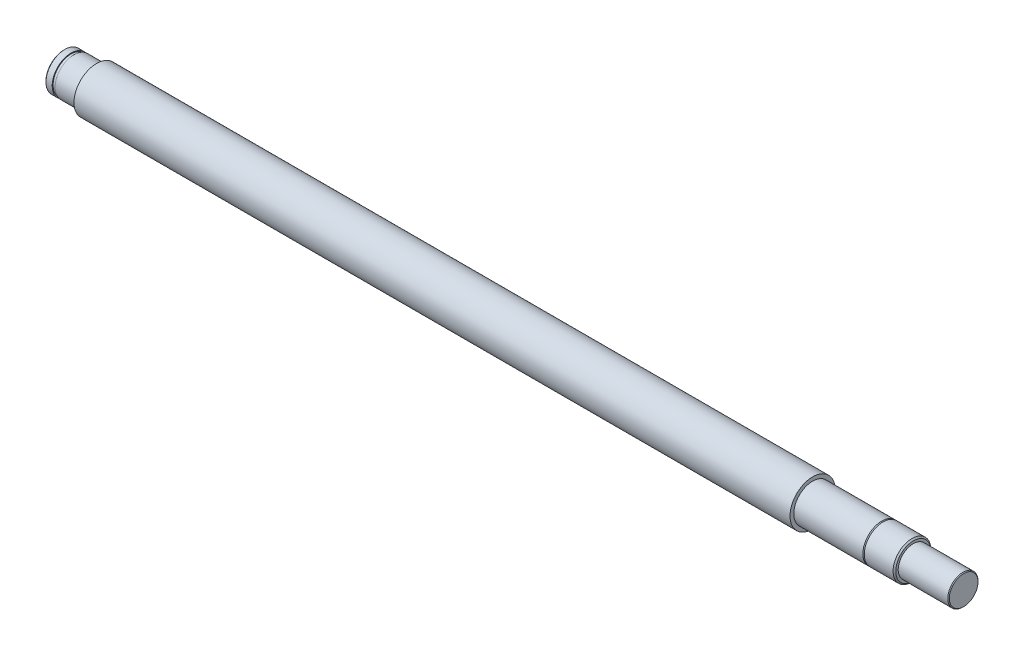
ISO-10303-21;
HEADER;
FILE_DESCRIPTION(('STEP AP214'),'2;1');
FILE_NAME('part.step','',(''),(''),'','','');
FILE_SCHEMA(('AUTOMOTIVE_DESIGN { 1 0 10303 214 1 1 1 1 }'));
ENDSEC;
DATA;
#1=APPLICATION_CONTEXT('core data for automotive mechanical design processes');
#2=APPLICATION_PROTOCOL_DEFINITION('international standard','automotive_design',2000,#1);
#3=PRODUCT_CONTEXT('',#1,'mechanical');
#4=PRODUCT('Part','Part','',(#3));
#5=PRODUCT_RELATED_PRODUCT_CATEGORY('part','',(#4));
#6=PRODUCT_DEFINITION_FORMATION('','',#4);
#7=PRODUCT_DEFINITION_CONTEXT('part definition',#1,'design');
#8=PRODUCT_DEFINITION('design','',#6,#7);
#9=PRODUCT_DEFINITION_SHAPE('','',#8);
#10=(LENGTH_UNIT() NAMED_UNIT(*) SI_UNIT(.MILLI.,.METRE.));
#11=(NAMED_UNIT(*) PLANE_ANGLE_UNIT() SI_UNIT($,.RADIAN.));
#12=(NAMED_UNIT(*) SI_UNIT($,.STERADIAN.) SOLID_ANGLE_UNIT());
#13=UNCERTAINTY_MEASURE_WITH_UNIT(LENGTH_MEASURE(1.E-05),#10,'distance_accuracy_value','');
#14=(GEOMETRIC_REPRESENTATION_CONTEXT(3) GLOBAL_UNCERTAINTY_ASSIGNED_CONTEXT((#13)) GLOBAL_UNIT_ASSIGNED_CONTEXT((#10,
#11,#12)) REPRESENTATION_CONTEXT('',''));
#15=CARTESIAN_POINT('',(0.,0.,0.));
#16=DIRECTION('',(0.,0.,1.));
#17=DIRECTION('',(1.,0.,0.));
#18=AXIS2_PLACEMENT_3D('',#15,#16,#17);
#19=CARTESIAN_POINT('',(-70.1250000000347,0.,0.));
#20=DIRECTION('',(1.,0.,0.));
#21=DIRECTION('',(0.,0.,-1.));
#22=AXIS2_PLACEMENT_3D('',#19,#20,#21);
#23=CONICAL_SURFACE('',#22,7.49999999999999,0.78539816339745);
#24=CARTESIAN_POINT('',(-70.5000000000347,0.,0.));
#25=DIRECTION('',(1.,0.,0.));
#26=DIRECTION('',(0.,0.,-1.));
#27=AXIS2_PLACEMENT_3D('',#24,#25,#26);
#28=CIRCLE('',#27,7.12500000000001);
#29=CARTESIAN_POINT('',(-70.5000000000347,0.,-7.12500000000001));
#30=VERTEX_POINT('',#29);
#31=EDGE_CURVE('E107',#30,#30,#28,.T.);
#32=ORIENTED_EDGE('',*,*,#31,.T.);
#33=EDGE_LOOP('',(#32));
#34=FACE_BOUND('',#33,.T.);
#35=CARTESIAN_POINT('',(-70.1250000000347,0.,0.));
#36=DIRECTION('',(1.,0.,0.));
#37=DIRECTION('',(0.,0.,-1.));
#38=AXIS2_PLACEMENT_3D('',#35,#36,#37);
#39=CIRCLE('',#38,7.49999999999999);
#40=CARTESIAN_POINT('',(-70.1250000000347,0.,-7.5));
#41=VERTEX_POINT('',#40);
#42=EDGE_CURVE('E12',#41,#41,#39,.T.);
#43=ORIENTED_EDGE('',*,*,#42,.F.);
#44=EDGE_LOOP('',(#43));
#45=FACE_BOUND('',#44,.T.);
#46=ADVANCED_FACE('F49',(#34,#45),#23,.T.);
#47=CARTESIAN_POINT('',(-70.5000000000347,0.,0.));
#48=DIRECTION('',(1.,0.,0.));
#49=DIRECTION('',(0.,0.,-1.));
#50=AXIS2_PLACEMENT_3D('',#47,#48,#49);
#51=CYLINDRICAL_SURFACE('',#50,7.49999999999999);
#52=ORIENTED_EDGE('',*,*,#42,.T.);
#53=EDGE_LOOP('',(#52));
#54=FACE_BOUND('',#53,.T.);
#55=CARTESIAN_POINT('',(-67.6500000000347,0.,0.));
#56=DIRECTION('',(1.,0.,0.));
#57=DIRECTION('',(0.,0.,-1.));
#58=AXIS2_PLACEMENT_3D('',#55,#56,#57);
#59=CIRCLE('',#58,7.49999999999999);
#60=CARTESIAN_POINT('',(-67.6500000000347,0.,-7.5));
#61=VERTEX_POINT('',#60);
#62=EDGE_CURVE('E55',#61,#61,#59,.T.);
#63=ORIENTED_EDGE('',*,*,#62,.F.);
#64=EDGE_LOOP('',(#63));
#65=FACE_BOUND('',#64,.T.);
#66=ADVANCED_FACE('F124',(#54,#65),#51,.T.);
#67=CARTESIAN_POINT('',(-67.6500000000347,7.15,0.));
#68=DIRECTION('',(1.,0.,0.));
#69=DIRECTION('',(0.,0.,-1.));
#70=AXIS2_PLACEMENT_3D('',#67,#68,#69);
#71=PLANE('',#70);
#72=ORIENTED_EDGE('',*,*,#62,.T.);
#73=EDGE_LOOP('',(#72));
#74=FACE_BOUND('',#73,.T.);
#75=CARTESIAN_POINT('',(-67.6500000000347,0.,0.));
#76=DIRECTION('',(1.,0.,0.));
#77=DIRECTION('',(0.,0.,-1.));
#78=AXIS2_PLACEMENT_3D('',#75,#76,#77);
#79=CIRCLE('',#78,7.15);
#80=CARTESIAN_POINT('',(-67.6500000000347,0.,-7.15));
#81=VERTEX_POINT('',#80);
#82=EDGE_CURVE('E59',#81,#81,#79,.T.);
#83=ORIENTED_EDGE('',*,*,#82,.F.);
#84=EDGE_LOOP('',(#83));
#85=FACE_BOUND('',#84,.T.);
#86=ADVANCED_FACE('F128',(#74,#85),#71,.T.);
#87=CARTESIAN_POINT('',(-70.5000000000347,0.,0.));
#88=DIRECTION('',(1.,0.,0.));
#89=DIRECTION('',(0.,0.,-1.));
#90=AXIS2_PLACEMENT_3D('',#87,#88,#89);
#91=CYLINDRICAL_SURFACE('',#90,7.15);
#92=ORIENTED_EDGE('',*,*,#82,.T.);
#93=EDGE_LOOP('',(#92));
#94=FACE_BOUND('',#93,.T.);
#95=CARTESIAN_POINT('',(-66.5000000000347,0.,0.));
#96=DIRECTION('',(1.,0.,0.));
#97=DIRECTION('',(0.,0.,-1.));
#98=AXIS2_PLACEMENT_3D('',#95,#96,#97);
#99=CIRCLE('',#98,7.15);
#100=CARTESIAN_POINT('',(-66.5000000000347,0.,-7.15));
#101=VERTEX_POINT('',#100);
#102=EDGE_CURVE('E63',#101,#101,#99,.T.);
#103=ORIENTED_EDGE('',*,*,#102,.F.);
#104=EDGE_LOOP('',(#103));
#105=FACE_BOUND('',#104,.T.);
#106=ADVANCED_FACE('F132',(#94,#105),#91,.T.);
#107=CARTESIAN_POINT('',(-66.5000000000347,7.49999999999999,0.));
#108=DIRECTION('',(-1.,0.,0.));
#109=DIRECTION('',(0.,0.,1.));
#110=AXIS2_PLACEMENT_3D('',#107,#108,#109);
#111=PLANE('',#110);
#112=ORIENTED_EDGE('',*,*,#102,.T.);
#113=EDGE_LOOP('',(#112));
#114=FACE_BOUND('',#113,.T.);
#115=CARTESIAN_POINT('',(-66.5000000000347,0.,0.));
#116=DIRECTION('',(1.,0.,0.));
#117=DIRECTION('',(0.,0.,-1.));
#118=AXIS2_PLACEMENT_3D('',#115,#116,#117);
#119=CIRCLE('',#118,7.49999999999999);
#120=CARTESIAN_POINT('',(-66.5000000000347,0.,-7.5));
#121=VERTEX_POINT('',#120);
#122=EDGE_CURVE('E68',#121,#121,#119,.T.);
#123=ORIENTED_EDGE('',*,*,#122,.F.);
#124=EDGE_LOOP('',(#123));
#125=FACE_BOUND('',#124,.T.);
#126=ADVANCED_FACE('F138',(#114,#125),#111,.T.);
#127=CARTESIAN_POINT('',(-70.5000000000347,0.,0.));
#128=DIRECTION('',(1.,0.,0.));
#129=DIRECTION('',(0.,0.,-1.));
#130=AXIS2_PLACEMENT_3D('',#127,#128,#129);
#131=CYLINDRICAL_SURFACE('',#130,7.49999999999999);
#132=ORIENTED_EDGE('',*,*,#122,.T.);
#133=EDGE_LOOP('',(#132));
#134=FACE_BOUND('',#133,.T.);
#135=CARTESIAN_POINT('',(-57.5000000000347,0.,0.));
#136=DIRECTION('',(1.,0.,0.));
#137=DIRECTION('',(0.,0.,-1.));
#138=AXIS2_PLACEMENT_3D('',#135,#136,#137);
#139=CIRCLE('',#138,7.49999999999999);
#140=CARTESIAN_POINT('',(-57.5000000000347,0.,-7.5));
#141=VERTEX_POINT('',#140);
#142=EDGE_CURVE('E71',#141,#141,#139,.T.);
#143=ORIENTED_EDGE('',*,*,#142,.F.);
#144=EDGE_LOOP('',(#143));
#145=FACE_BOUND('',#144,.T.);
#146=ADVANCED_FACE('F142',(#134,#145),#131,.T.);
#147=CARTESIAN_POINT('',(-57.5000000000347,8.99999999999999,0.));
#148=DIRECTION('',(-1.,0.,0.));
#149=DIRECTION('',(0.,0.,1.));
#150=AXIS2_PLACEMENT_3D('',#147,#148,#149);
#151=PLANE('',#150);
#152=ORIENTED_EDGE('',*,*,#142,.T.);
#153=EDGE_LOOP('',(#152));
#154=FACE_BOUND('',#153,.T.);
#155=CARTESIAN_POINT('',(-57.5000000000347,0.,0.));
#156=DIRECTION('',(1.,0.,0.));
#157=DIRECTION('',(0.,0.,-1.));
#158=AXIS2_PLACEMENT_3D('',#155,#156,#157);
#159=CIRCLE('',#158,8.99999999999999);
#160=CARTESIAN_POINT('',(-57.5000000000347,0.,-9.));
#161=VERTEX_POINT('',#160);
#162=EDGE_CURVE('E74',#161,#161,#159,.T.);
#163=ORIENTED_EDGE('',*,*,#162,.F.);
#164=EDGE_LOOP('',(#163));
#165=FACE_BOUND('',#164,.T.);
#166=ADVANCED_FACE('F146',(#154,#165),#151,.T.);
#167=CARTESIAN_POINT('',(-70.5000000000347,0.,0.));
#168=DIRECTION('',(1.,0.,0.));
#169=DIRECTION('',(0.,0.,-1.));
#170=AXIS2_PLACEMENT_3D('',#167,#168,#169);
#171=CYLINDRICAL_SURFACE('',#170,9.00000000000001);
#172=ORIENTED_EDGE('',*,*,#162,.T.);
#173=EDGE_LOOP('',(#172));
#174=FACE_BOUND('',#173,.T.);
#175=CARTESIAN_POINT('',(227.,0.,0.));
#176=DIRECTION('',(1.,0.,0.));
#177=DIRECTION('',(0.,0.,-1.));
#178=AXIS2_PLACEMENT_3D('',#175,#176,#177);
#179=CIRCLE('',#178,9.00000000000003);
#180=CARTESIAN_POINT('',(227.,0.,-9.00000000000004));
#181=VERTEX_POINT('',#180);
#182=EDGE_CURVE('E77',#181,#181,#179,.T.);
#183=ORIENTED_EDGE('',*,*,#182,.F.);
#184=EDGE_LOOP('',(#183));
#185=FACE_BOUND('',#184,.T.);
#186=ADVANCED_FACE('F150',(#174,#185),#171,.T.);
#187=CARTESIAN_POINT('',(227.,7.50000000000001,0.));
#188=DIRECTION('',(1.,0.,0.));
#189=DIRECTION('',(0.,0.,-1.));
#190=AXIS2_PLACEMENT_3D('',#187,#188,#189);
#191=PLANE('',#190);
#192=ORIENTED_EDGE('',*,*,#182,.T.);
#193=EDGE_LOOP('',(#192));
#194=FACE_BOUND('',#193,.T.);
#195=CARTESIAN_POINT('',(227.,0.,0.));
#196=DIRECTION('',(1.,0.,0.));
#197=DIRECTION('',(0.,0.,-1.));
#198=AXIS2_PLACEMENT_3D('',#195,#196,#197);
#199=CIRCLE('',#198,7.5);
#200=CARTESIAN_POINT('',(227.,0.,-7.50000000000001));
#201=VERTEX_POINT('',#200);
#202=EDGE_CURVE('E80',#201,#201,#199,.T.);
#203=ORIENTED_EDGE('',*,*,#202,.F.);
#204=EDGE_LOOP('',(#203));
#205=FACE_BOUND('',#204,.T.);
#206=ADVANCED_FACE('F154',(#194,#205),#191,.T.);
#207=CARTESIAN_POINT('',(-70.5000000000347,0.,0.));
#208=DIRECTION('',(1.,0.,0.));
#209=DIRECTION('',(0.,0.,-1.));
#210=AXIS2_PLACEMENT_3D('',#207,#208,#209);
#211=CYLINDRICAL_SURFACE('',#210,7.5);
#212=ORIENTED_EDGE('',*,*,#202,.T.);
#213=EDGE_LOOP('',(#212));
#214=FACE_BOUND('',#213,.T.);
#215=CARTESIAN_POINT('',(254.45875,0.,0.));
#216=DIRECTION('',(1.,0.,0.));
#217=DIRECTION('',(0.,0.,-1.));
#218=AXIS2_PLACEMENT_3D('',#215,#216,#217);
#219=CIRCLE('',#218,7.5);
#220=CARTESIAN_POINT('',(254.45875,0.,-7.50000000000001));
#221=VERTEX_POINT('',#220);
#222=EDGE_CURVE('E83',#221,#221,#219,.T.);
#223=ORIENTED_EDGE('',*,*,#222,.F.);
#224=EDGE_LOOP('',(#223));
#225=FACE_BOUND('',#224,.T.);
#226=ADVANCED_FACE('F158',(#214,#225),#211,.T.);
#227=CARTESIAN_POINT('',(255.,0.,0.));
#228=DIRECTION('',(-1.,0.,0.));
#229=DIRECTION('',(0.,0.,1.));
#230=AXIS2_PLACEMENT_3D('',#227,#228,#229);
#231=CONICAL_SURFACE('',#230,6.95875000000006,0.785398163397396);
#232=ORIENTED_EDGE('',*,*,#222,.T.);
#233=EDGE_LOOP('',(#232));
#234=FACE_BOUND('',#233,.T.);
#235=CARTESIAN_POINT('',(255.,0.,0.));
#236=DIRECTION('',(1.,0.,0.));
#237=DIRECTION('',(0.,0.,-1.));
#238=AXIS2_PLACEMENT_3D('',#235,#236,#237);
#239=CIRCLE('',#238,6.95875000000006);
#240=CARTESIAN_POINT('',(255.,0.,-6.95875000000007));
#241=VERTEX_POINT('',#240);
#242=EDGE_CURVE('E86',#241,#241,#239,.T.);
#243=ORIENTED_EDGE('',*,*,#242,.F.);
#244=EDGE_LOOP('',(#243));
#245=FACE_BOUND('',#244,.T.);
#246=ADVANCED_FACE('F162',(#234,#245),#231,.T.);
#247=CARTESIAN_POINT('',(255.,7.50000000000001,0.));
#248=DIRECTION('',(-1.,0.,0.));
#249=DIRECTION('',(0.,0.,1.));
#250=AXIS2_PLACEMENT_3D('',#247,#248,#249);
#251=PLANE('',#250);
#252=ORIENTED_EDGE('',*,*,#242,.T.);
#253=EDGE_LOOP('',(#252));
#254=FACE_BOUND('',#253,.T.);
#255=CARTESIAN_POINT('',(255.,0.,0.));
#256=DIRECTION('',(1.,0.,0.));
#257=DIRECTION('',(0.,0.,-1.));
#258=AXIS2_PLACEMENT_3D('',#255,#256,#257);
#259=CIRCLE('',#258,7.5);
#260=CARTESIAN_POINT('',(255.,0.,-7.50000000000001));
#261=VERTEX_POINT('',#260);
#262=EDGE_CURVE('E89',#261,#261,#259,.T.);
#263=ORIENTED_EDGE('',*,*,#262,.F.);
#264=EDGE_LOOP('',(#263));
#265=FACE_BOUND('',#264,.T.);
#266=ADVANCED_FACE('F166',(#254,#265),#251,.T.);
#267=CARTESIAN_POINT('',(-70.5000000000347,0.,0.));
#268=DIRECTION('',(1.,0.,0.));
#269=DIRECTION('',(0.,0.,-1.));
#270=AXIS2_PLACEMENT_3D('',#267,#268,#269);
#271=CYLINDRICAL_SURFACE('',#270,7.5);
#272=ORIENTED_EDGE('',*,*,#262,.T.);
#273=EDGE_LOOP('',(#272));
#274=FACE_BOUND('',#273,.T.);
#275=CARTESIAN_POINT('',(266.45875,0.,0.));
#276=DIRECTION('',(1.,0.,0.));
#277=DIRECTION('',(0.,0.,-1.));
#278=AXIS2_PLACEMENT_3D('',#275,#276,#277);
#279=CIRCLE('',#278,7.5);
#280=CARTESIAN_POINT('',(266.45875,0.,-7.50000000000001));
#281=VERTEX_POINT('',#280);
#282=EDGE_CURVE('E92',#281,#281,#279,.T.);
#283=ORIENTED_EDGE('',*,*,#282,.F.);
#284=EDGE_LOOP('',(#283));
#285=FACE_BOUND('',#284,.T.);
#286=ADVANCED_FACE('F170',(#274,#285),#271,.T.);
#287=CARTESIAN_POINT('',(267.,0.,0.));
#288=DIRECTION('',(-1.,0.,0.));
#289=DIRECTION('',(0.,0.,1.));
#290=AXIS2_PLACEMENT_3D('',#287,#288,#289);
#291=CONICAL_SURFACE('',#290,6.95875,0.785398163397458);
#292=ORIENTED_EDGE('',*,*,#282,.T.);
#293=EDGE_LOOP('',(#292));
#294=FACE_BOUND('',#293,.T.);
#295=CARTESIAN_POINT('',(267.,0.,0.));
#296=DIRECTION('',(1.,0.,0.));
#297=DIRECTION('',(0.,0.,-1.));
#298=AXIS2_PLACEMENT_3D('',#295,#296,#297);
#299=CIRCLE('',#298,6.95875);
#300=CARTESIAN_POINT('',(267.,0.,-6.95875));
#301=VERTEX_POINT('',#300);
#302=EDGE_CURVE('E95',#301,#301,#299,.T.);
#303=ORIENTED_EDGE('',*,*,#302,.F.);
#304=EDGE_LOOP('',(#303));
#305=FACE_BOUND('',#304,.T.);
#306=ADVANCED_FACE('F174',(#294,#305),#291,.T.);
#307=CARTESIAN_POINT('',(267.,6.00000000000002,0.));
#308=DIRECTION('',(1.,0.,0.));
#309=DIRECTION('',(0.,0.,-1.));
#310=AXIS2_PLACEMENT_3D('',#307,#308,#309);
#311=PLANE('',#310);
#312=ORIENTED_EDGE('',*,*,#302,.T.);
#313=EDGE_LOOP('',(#312));
#314=FACE_BOUND('',#313,.T.);
#315=CARTESIAN_POINT('',(267.,0.,0.));
#316=DIRECTION('',(1.,0.,0.));
#317=DIRECTION('',(0.,0.,-1.));
#318=AXIS2_PLACEMENT_3D('',#315,#316,#317);
#319=CIRCLE('',#318,6.);
#320=CARTESIAN_POINT('',(267.,0.,-6.00000000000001));
#321=VERTEX_POINT('',#320);
#322=EDGE_CURVE('E98',#321,#321,#319,.T.);
#323=ORIENTED_EDGE('',*,*,#322,.F.);
#324=EDGE_LOOP('',(#323));
#325=FACE_BOUND('',#324,.T.);
#326=ADVANCED_FACE('F178',(#314,#325),#311,.T.);
#327=CARTESIAN_POINT('',(-70.5000000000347,0.,0.));
#328=DIRECTION('',(1.,0.,0.));
#329=DIRECTION('',(0.,0.,-1.));
#330=AXIS2_PLACEMENT_3D('',#327,#328,#329);
#331=CYLINDRICAL_SURFACE('',#330,6.);
#332=ORIENTED_EDGE('',*,*,#322,.T.);
#333=EDGE_LOOP('',(#332));
#334=FACE_BOUND('',#333,.T.);
#335=CARTESIAN_POINT('',(286.7,0.,0.));
#336=DIRECTION('',(1.,0.,0.));
#337=DIRECTION('',(0.,0.,-1.));
#338=AXIS2_PLACEMENT_3D('',#335,#336,#337);
#339=CIRCLE('',#338,6.);
#340=CARTESIAN_POINT('',(286.7,0.,-6.00000000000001));
#341=VERTEX_POINT('',#340);
#342=EDGE_CURVE('E101',#341,#341,#339,.T.);
#343=ORIENTED_EDGE('',*,*,#342,.F.);
#344=EDGE_LOOP('',(#343));
#345=FACE_BOUND('',#344,.T.);
#346=ADVANCED_FACE('F182',(#334,#345),#331,.T.);
#347=CARTESIAN_POINT('',(286.999999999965,0.,0.));
#348=DIRECTION('',(-1.,0.,0.));
#349=DIRECTION('',(0.,0.,1.));
#350=AXIS2_PLACEMENT_3D('',#347,#348,#349);
#351=CONICAL_SURFACE('',#350,5.70000000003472,0.785398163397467);
#352=ORIENTED_EDGE('',*,*,#342,.T.);
#353=EDGE_LOOP('',(#352));
#354=FACE_BOUND('',#353,.T.);
#355=CARTESIAN_POINT('',(286.999999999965,0.,0.));
#356=DIRECTION('',(1.,0.,0.));
#357=DIRECTION('',(0.,0.,-1.));
#358=AXIS2_PLACEMENT_3D('',#355,#356,#357);
#359=CIRCLE('',#358,5.70000000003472);
#360=CARTESIAN_POINT('',(286.999999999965,0.,-5.70000000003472));
#361=VERTEX_POINT('',#360);
#362=EDGE_CURVE('E104',#361,#361,#359,.T.);
#363=ORIENTED_EDGE('',*,*,#362,.F.);
#364=EDGE_LOOP('',(#363));
#365=FACE_BOUND('',#364,.T.);
#366=ADVANCED_FACE('F120',(#354,#365),#351,.T.);
#367=CARTESIAN_POINT('',(286.999999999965,0.,0.));
#368=DIRECTION('',(1.,0.,0.));
#369=DIRECTION('',(0.,0.,-1.));
#370=AXIS2_PLACEMENT_3D('',#367,#368,#369);
#371=PLANE('',#370);
#372=ORIENTED_EDGE('',*,*,#362,.T.);
#373=EDGE_LOOP('',(#372));
#374=FACE_BOUND('',#373,.T.);
#375=ADVANCED_FACE('F115',(#374),#371,.T.);
#376=CARTESIAN_POINT('',(-70.5000000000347,7.12500000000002,0.));
#377=DIRECTION('',(-1.,0.,0.));
#378=DIRECTION('',(0.,0.,1.));
#379=AXIS2_PLACEMENT_3D('',#376,#377,#378);
#380=PLANE('',#379);
#381=ORIENTED_EDGE('',*,*,#31,.F.);
#382=EDGE_LOOP('',(#381));
#383=FACE_BOUND('',#382,.T.);
#384=ADVANCED_FACE('F113',(#383),#380,.T.);
#385=CLOSED_SHELL('',(#46,#66,#86,#106,#126,#146,#166,#186,#206,#226,#246,#266,#286,#306,#326,
#346,#366,#375,#384));
#386=MANIFOLD_SOLID_BREP('B2',#385);
#387=ADVANCED_BREP_SHAPE_REPRESENTATION('',(#18,#386),#14);
#388=SHAPE_DEFINITION_REPRESENTATION(#9,#387);
ENDSEC;
END-ISO-10303-21;
